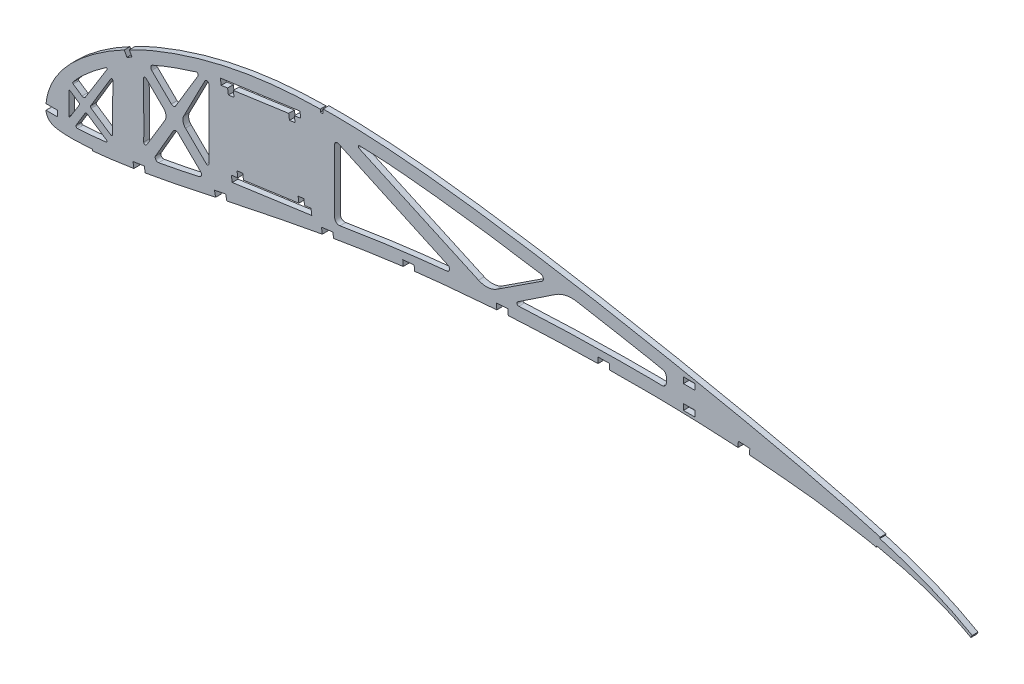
from build123d import *

# Parameters (mm, degrees)
MODEL_W             = 6.47730786
MODEL_H             = 3.303251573
MODEL_W_2           = 6.477307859
MODEL_H_2           = 3.303251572
BOSS_EXTRUDE7_DEPTH = 3.175


with BuildPart() as part:
    # Model → Boss-Extrude7 (new body)
    with BuildSketch(Plane.XY):
        with BuildLine():
            Line((44.11726, 61.64326), (45.60824, 58.8391))
            Line((45.60824, 58.8391), (48.41434449, 60.332466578))
            Line((48.41434449, 60.332466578), (46.920851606, 63.132769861))
            add(Edge.make_bspline(
                [(46.920851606, 63.132769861), (47.82292602, 63.592631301), (54.586728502, 67.040697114), (67.00115914, 72.239517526), (85.999370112, 78.543805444), (103.594629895, 82.784628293), (120.342975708, 85.455818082), (134.492681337, 86.848786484), (145.275231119, 87.430871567), (151.345831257, 87.508813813), (152.5651, 87.524468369)],
                knots=[0, 0, 0, 0, 0.027777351, 0.20827607, 0.368417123, 0.576646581, 0.703920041, 0.833446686, 0.966548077, 1, 1, 1, 1], degree=3))
            Line((152.5651, 87.524468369), (152.5651, 85.98916))
            Line((152.5651, 85.98916), (154.1526, 85.98916))
            Line((154.1526, 85.98916), (154.1526, 87.57666))
            Line((154.1526, 87.57666), (154.1526, 88.37041))
            add(Edge.make_bspline(
                [(154.1526, 88.37041), (155.731621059, 88.385872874), (160.738104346, 88.434899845), (169.278137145, 88.311070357), (178.043177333, 87.989357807), (188.981957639, 87.37798333), (200.276233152, 86.52788621), (215.806351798, 84.979052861), (229.921761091, 83.334316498), (246.609316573, 81.120828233), (263.91237427, 78.583748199), (283.860841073, 75.395508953), (304.320123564, 71.869920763), (322.823494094, 68.500988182), (341.61883959, 64.920930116), (360.548867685, 61.18513738), (381.686657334, 56.842811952), (402.303143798, 52.414912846), (422.02245449, 47.928771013), (438.656319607, 43.811278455), (451.970977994, 40.305188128), (459.066017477, 38.253438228), (462.32826, 37.31006)],
                knots=[0, 0, 0, 0, 0.015130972, 0.047974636, 0.081828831, 0.099168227, 0.15295402, 0.190340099, 0.248713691, 0.289115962, 0.351640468, 0.416281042, 0.482686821, 0.550570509, 0.596495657, 0.666024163, 0.735457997, 0.803268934, 0.868077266, 0.929230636, 0.967460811, 1, 1, 1, 1], degree=3))
            Line((462.32826, 37.31006), (462.116962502, 36.544950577))
            add(Edge.make_bspline(
                [(462.116962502, 36.544950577), (463.995110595, 35.983666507), (467.426475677, 34.958203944), (473.768868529, 32.94513194), (482.171898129, 30.081471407), (494.785513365, 25.218860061), (505.417506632, 20.052610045), (512.072642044, 16.352628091), (513.259850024, 15.692589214)],
                knots=[0, 0, 0, 0, 0.106235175, 0.194091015, 0.360618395, 0.587307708, 0.926379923, 1, 1, 1, 1], degree=3))
            Line((513.259850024, 15.692589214), (512.499875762, 14.298819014))
            add(Edge.make_bspline(
                [(508.92456, 16.23822), (509.568091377, 15.898378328), (510.767083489, 15.265204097), (511.951272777, 14.604777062), (512.499875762, 14.298819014)],
                knots=[0, 0, 0, 0, 0.536726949, 1, 1, 1, 1], degree=3))
            add(Edge.make_bspline(
                [(460.255447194, 32.208926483), (461.617944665, 31.924214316), (464.592025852, 31.302740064), (469.103767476, 30.255677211), (473.749242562, 29.117124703), (479.621798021, 27.56086396), (485.270409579, 25.899558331), (490.681181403, 24.076034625), (494.539391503, 22.674561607), (499.45836344, 20.721515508), (504.185497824, 18.584058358), (507.709797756, 16.887042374), (508.873776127, 16.265344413), (508.92456, 16.23822)],
                knots=[0, 0, 0, 0, 0.081264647, 0.177385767, 0.27039723, 0.360503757, 0.532076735, 0.614018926, 0.693834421, 0.771711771, 0.922956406, 0.996638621, 1, 1, 1, 1], degree=3))
            Line((460.255447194, 32.208926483), (460.09052, 31.4325))
            add(Edge.make_bspline(
                [(390.003479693, 40.570138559), (393.696133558, 40.308189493), (401.171556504, 39.777898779), (424.531857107, 37.271017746), (425.846732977, 37.247744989), (454.276477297, 32.811532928), (457.934486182, 31.944314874), (460.09052, 31.4325)],
                knots=[8.375363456, 8.375363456, 8.375363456, 8.375363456, 9.097405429, 9.837068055, 10.547645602, 11.002273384, 11.654976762, 11.654976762, 11.654976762, 11.654976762], degree=3))
            Line((390.003479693, 40.570138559), (390.189727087, 43.73967116))
            Line((390.189727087, 43.73967116), (383.850661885, 44.112165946))
            Line((383.850661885, 44.112165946), (383.664414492, 40.942633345))
            add(Edge.make_bspline(
                [(312.561528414, 42.518811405), (322.73029164, 42.578750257), (342.721474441, 42.69658647), (352.274604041, 42.194357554), (358.110038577, 42.247737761), (377.858355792, 41.263078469), (383.664414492, 40.942633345)],
                knots=[5.389051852, 5.389051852, 5.389051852, 5.389051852, 6.221304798, 7.025211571, 7.816696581, 8.314761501, 8.314761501, 8.314761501, 8.314761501], degree=3))
            Line((312.561528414, 42.518811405), (312.502085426, 45.693254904))
            Line((312.502085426, 45.693254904), (306.153198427, 45.574368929))
            Line((306.153198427, 45.574368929), (306.212641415, 42.39992543))
            add(Edge.make_bspline(
                [(256.577425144, 40.578467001), (258.19472619, 40.658717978), (261.436419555, 40.819571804), (280.799490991, 41.85157121), (299.501844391, 42.26806952), (306.212641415, 42.39992543)],
                knots=[2.812859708, 2.812859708, 2.812859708, 2.812859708, 3.584253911, 4.359030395, 4.978471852, 4.978471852, 4.978471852, 4.978471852], degree=3))
            Line((256.577425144, 40.578467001), (256.369159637, 43.746629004))
            Line((256.369159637, 43.746629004), (250.032835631, 43.330097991))
            Line((250.032835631, 43.330097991), (250.241101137, 40.161935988))
            add(Edge.make_bspline(
                [(204.757182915, 35.911020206), (207.188287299, 36.238548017), (211.504927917, 36.820102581), (240.327107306, 39.398134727), (248.563483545, 40.038807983), (250.241101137, 40.161935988)],
                knots=[0.842709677, 0.842709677, 0.842709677, 0.842709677, 1.815502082, 2.569988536, 2.796712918, 2.796712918, 2.796712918, 2.796712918], degree=3))
            Line((204.757182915, 35.911020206), (204.510421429, 38.770329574))
            Line((204.510421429, 38.770329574), (198.183937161, 38.22434715))
            Line((198.183937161, 38.22434715), (198.456928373, 35.061105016))
            add(Edge.make_bspline(
                [(159.926988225, 29.230952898), (164.609031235, 30.026553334), (177.525153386, 32.221337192), (192.116139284, 34.204755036), (198.456928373, 35.061105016)],
                knots=[0.005843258, 0.005843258, 0.005843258, 0.005843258, 0.281642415, 0.766676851, 0.766676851, 0.766676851, 0.766676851], degree=3))
            Line((159.926988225, 29.230952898), (159.548459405, 32.106506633))
            Line((159.548459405, 32.106506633), (153.252771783, 31.277762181))
            Line((153.252771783, 31.277762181), (153.667144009, 28.12991837))
            add(Edge.make_bspline(
                [(100.870519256, 17.62722602), (118.428129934, 21.332147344), (136.005073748, 24.964562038), (153.667144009, 28.12991837)],
                knots=[0.095249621, 0.095249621, 0.095249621, 0.095249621, 0.904455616, 0.904455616, 0.904455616, 0.904455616], degree=3))
            Line((100.870519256, 17.62722602), (100.230904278, 20.700792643))
            Line((100.230904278, 20.700792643), (94.011199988, 19.421035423))
            Line((94.011199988, 19.421035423), (94.671227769, 16.316564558))
            add(Edge.make_bspline(
                [(55.714636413, 8.524872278), (59.215079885, 9.149121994), (68.515890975, 10.807777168), (79.958069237, 13.197959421), (89.166671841, 15.138574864), (92.791642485, 15.914328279), (94.671227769, 16.316564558)],
                knots=[0.913791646, 0.913791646, 0.913791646, 0.913791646, 1.019423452, 1.194459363, 1.559412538, 1.952426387, 1.952426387, 1.952426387, 1.952426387], degree=3))
            Line((55.714636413, 8.524872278), (55.24234016, 11.589660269))
            Line((55.24234016, 11.589660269), (48.96642333, 10.622516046))
            Line((48.96642333, 10.622516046), (49.449995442, 7.484557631))
            add(Edge.make_bspline(
                [(26.438090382, 4.490846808), (27.430041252, 4.584287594), (29.150153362, 4.746320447), (31.650283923, 5.010892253), (34.000866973, 5.285360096), (36.520751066, 5.596172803), (39.2645288, 5.962779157), (42.107322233, 6.367747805), (45.684612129, 6.898909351), (46.887584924, 7.075295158), (49.195675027, 7.443938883), (49.449995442, 7.484557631)],
                knots=[0, 0, 0, 0, 0.117673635, 0.204054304, 0.29697244, 0.397031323, 0.504572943, 0.621231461, 0.747479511, 0.884171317, 0.901098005, 0.901098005, 0.901098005, 0.901098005], degree=3))
            Line((26.438090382, 4.490846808), (26.438090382, 5.284596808))
            add(Edge.make_bspline(
                [(0.841145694, 11.1125), (0.863442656, 10.889970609), (0.909573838, 10.429569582), (1.069825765, 9.747093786), (1.301062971, 9.077383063), (1.708250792, 8.23412392), (2.292441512, 7.480192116), (3.009825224, 6.83919175), (3.63339512, 6.400167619), (4.345267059, 6.045402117), (5.12230745, 5.733024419), (6.283242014, 5.403878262), (7.874796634, 5.096633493), (9.943301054, 4.89784748), (12.203632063, 4.756375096), (14.67395361, 4.684447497), (17.384104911, 4.708507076), (20.975747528, 4.860595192), (24.026581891, 5.059714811), (26.081951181, 5.251385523), (26.438090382, 5.284596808)],
                knots=[0, 0, 0, 0, 0.023329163, 0.04826675, 0.072978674, 0.097172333, 0.145790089, 0.171203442, 0.197489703, 0.225123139, 0.254044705, 0.284812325, 0.350946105, 0.422955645, 0.501603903, 0.587380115, 0.680901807, 0.784488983, 0.962657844, 1, 1, 1, 1], degree=3))
            Line((0.841145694, 11.1125), (7.19093421, 11.1125))
            Line((7.19093421, 11.1125), (7.19093421, 14.2875))
            Line((7.19093421, 14.2875), (0.896044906, 14.2875))
            add(Edge.make_bspline(
                [(0.896044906, 14.2875), (0.947375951, 14.856703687), (1.077493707, 16.29956358), (1.973597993, 20.742309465), (4.336981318, 26.915290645), (9.140267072, 34.386332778), (15.19099943, 41.228238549), (23.206475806, 48.343435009), (31.783070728, 54.467491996), (39.073511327, 58.940266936), (42.922002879, 61.002710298), (44.11726, 61.64326)],
                knots=[0, 0, 0, 0, 0.025762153, 0.065303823, 0.204051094, 0.320574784, 0.464326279, 0.614539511, 0.803095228, 0.938845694, 1, 1, 1, 1], degree=3))
        make_face()
        Polygon((97.294789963, 74.766201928), (97.75444, 71.49846), (101.291565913, 71.995482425), (101.72733034, 68.850528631), (104.876507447, 69.293032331), (104.435677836, 72.437280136), (135.088849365, 76.744538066), (135.508539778, 73.597158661), (138.652618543, 74.039192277), (138.232974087, 77.186337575), (141.7701, 77.68336), (141.310449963, 80.953641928), align=None, mode=Mode.SUBTRACT)
        with Locations((356.689505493, 58.082031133)):
            Rectangle(MODEL_W, MODEL_H, mode=Mode.SUBTRACT)
        with Locations((356.689506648, 45.25377956)):
            Rectangle(MODEL_W_2, MODEL_H_2, mode=Mode.SUBTRACT)
        with BuildLine():
            Line((84.930266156, 69.579431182), (72.602920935, 49.090167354))
            ThreePointArc((72.602920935, 49.090167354), (71.458940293, 48.34413983), (70.164568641, 48.779858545))
            Line((70.164568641, 48.779858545), (59.305800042, 59.436474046))
            ThreePointArc((59.305800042, 59.436474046), (58.828604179, 60.940489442), (59.805839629, 62.179355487))
            add(Edge.make_bspline(
                [(59.805839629, 62.179355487), (60.736017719, 62.589575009), (65.348818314, 64.588630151), (73.479838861, 67.65614267), (80.775975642, 70.053398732), (83.839548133, 70.980448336)],
                knots=[0, 0, 0, 0, 0.121620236, 0.618319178, 1, 1, 1, 1], degree=3))
            ThreePointArc((83.839548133, 70.980448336), (84.865765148, 70.654296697), (84.930266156, 69.579431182))
        make_face(mode=Mode.SUBTRACT)
        with BuildLine():
            Line((77.20377034, 46.768465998), (88.74331387, 69.136989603))
            ThreePointArc((88.74331387, 69.136989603), (90.038311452, 69.75605795), (90.96248, 68.657797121))
            Line((90.96248, 68.657797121), (90.96248, 30.423322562))
            ThreePointArc((90.96248, 30.423322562), (90.456989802, 29.631278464), (89.528642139, 29.776277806))
            Line((89.528642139, 29.776277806), (77.973411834, 41.116389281))
            ThreePointArc((77.973411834, 41.116389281), (76.621460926, 43.810733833), (77.20377034, 46.768465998))
        make_face(mode=Mode.SUBTRACT)
        with BuildLine():
            Line((86.369999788, 24.467387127), (73.88594559, 36.725249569))
            ThreePointArc((73.88594559, 36.725249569), (72.445974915, 37.203276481), (71.186033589, 36.357952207))
            Line((71.186033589, 36.357952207), (61.451577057, 19.517618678))
            ThreePointArc((61.451577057, 19.517618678), (61.530916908, 17.788245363), (63.13536968, 17.138046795))
            add(Edge.make_bspline(
                [(85.571247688, 21.70108314), (84.874800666, 21.5496818), (77.350460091, 19.756372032), (70.298205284, 18.478082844), (63.13536968, 17.138046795)],
                knots=[0, 0, 0, 0, 0.091867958, 1, 1, 1, 1], degree=3))
            ThreePointArc((85.571247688, 21.70108314), (86.795630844, 22.846019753), (86.369999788, 24.467387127))
        make_face(mode=Mode.SUBTRACT)
        with BuildLine():
            Line((66.584551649, 39.087043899), (56.549502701, 22.407802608))
            ThreePointArc((56.549502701, 22.407802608), (55.535770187, 22.011704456), (54.894615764, 22.891174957))
            add(Edge.make_bspline(
                [(54.894615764, 22.891174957), (55.166354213, 33.053589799), (54.693726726, 42.507557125), (54.72321766, 53.340426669)],
                knots=[0, 0, 0, 0, 1, 1, 1, 1], degree=3))
            ThreePointArc((54.72321766, 53.340426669), (55.291047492, 54.190692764), (56.29505411, 53.9974213))
            Line((56.29505411, 53.9974213), (65.88621165, 44.580040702))
            ThreePointArc((65.88621165, 44.580040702), (67.188549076, 41.954721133), (66.584551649, 39.087043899))
        make_face(mode=Mode.SUBTRACT)
        with BuildLine():
            Line((36.734244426, 44.162084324), (25.570519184, 25.667564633))
            ThreePointArc((25.570519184, 25.667564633), (25.465358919, 25.025425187), (25.832330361, 24.488085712))
            Line((25.832330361, 24.488085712), (36.596801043, 17.267320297))
            ThreePointArc((36.596801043, 17.267320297), (37.353170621, 17.232609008), (37.733761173, 17.887170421))
            add(Edge.make_bspline(
                [(37.733761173, 17.887170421), (37.703446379, 19.54055995), (37.87326363, 25.176274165), (37.762369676, 33.1191484), (37.78182944, 40.314960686), (37.781783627, 43.195015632), (37.781673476, 43.870554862)],
                knots=[0, 0, 0, 0, 0.189757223, 0.650834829, 0.92105654, 1, 1, 1, 1], degree=3))
            ThreePointArc((37.781673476, 43.870554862), (37.368675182, 44.414109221), (36.734244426, 44.162084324))
        make_face(mode=Mode.SUBTRACT)
        with BuildLine():
            Line((22.655802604, 28.299205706), (34.642400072, 47.59134405))
            ThreePointArc((34.642400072, 47.59134405), (34.604721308, 48.054747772), (34.150543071, 48.154170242))
            add(Edge.make_bspline(
                [(34.150543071, 48.154170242), (34.032642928, 48.101296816), (33.91325283, 48.043304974), (33.791033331, 47.982163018)],
                knots=[0, 0, 0, 0, 1, 1, 1, 1], degree=3))
            add(Edge.make_bspline(
                [(33.791033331, 47.982163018), (32.71498646, 47.234601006), (29.332669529, 44.863850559), (23.078601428, 39.891053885), (18.088351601, 34.945529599), (15.871305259, 32.253530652), (15.741066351, 32.09362211)],
                knots=[0, 0, 0, 0, 0.148043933, 0.546565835, 0.973269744, 1, 1, 1, 1], degree=3))
            ThreePointArc((15.741066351, 32.09362211), (15.605228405, 31.598252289), (15.879849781, 31.164171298))
            Line((15.879849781, 31.164171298), (20.759337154, 27.891029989))
            ThreePointArc((20.759337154, 27.891029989), (21.794200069, 27.692616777), (22.655802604, 28.299205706))
        make_face(mode=Mode.SUBTRACT)
        with BuildLine():
            Line((34.290434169, 13.58800385), (23.789372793, 20.64423634))
            ThreePointArc((23.789372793, 20.64423634), (22.998722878, 20.793681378), (22.345182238, 20.324271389))
            Line((22.345182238, 20.324271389), (17.50629624, 12.307872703))
            ThreePointArc((17.50629624, 12.307872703), (17.500606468, 11.481598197), (18.223640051, 11.081617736))
            add(Edge.make_bspline(
                [(18.223640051, 11.081617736), (20.453256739, 11.150531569), (25.156226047, 11.490511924), (30.602108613, 12.04749446), (33.518174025, 12.411292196), (34.027114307, 12.476068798)],
                knots=[0, 0, 0, 0, 0.417536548, 0.901821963, 1, 1, 1, 1], degree=3))
            ThreePointArc((34.027114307, 12.476068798), (34.543914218, 12.940830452), (34.290434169, 13.58800385))
        make_face(mode=Mode.SUBTRACT)
        with BuildLine():
            Line((13.996688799, 14.362571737), (19.272572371, 22.853978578))
            ThreePointArc((19.272572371, 22.853978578), (19.363715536, 23.378097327), (19.065370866, 23.818549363))
            Line((19.065370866, 23.818549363), (14.117205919, 27.143489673))
            ThreePointArc((14.117205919, 27.143489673), (13.730229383, 27.159659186), (13.540216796, 26.82215732))
            add(Edge.make_bspline(
                [(13.540216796, 26.82215732), (13.69574558, 22.634982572), (13.447809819, 18.942714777), (13.49501916, 14.502849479)],
                knots=[0, 0, 0, 0, 1, 1, 1, 1], degree=3))
            ThreePointArc((13.49501916, 14.502849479), (13.693222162, 14.244485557), (13.996688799, 14.362571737))
        make_face(mode=Mode.SUBTRACT)
        with BuildLine():
            Line((174.365301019, 80.849079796), (182.709330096, 80.547392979))
            add(Edge.make_bspline(
                [(182.709330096, 80.547392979), (189.199816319, 80.31272288), (203.912201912, 79.031919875), (224.705822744, 76.788018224), (247.03872104, 73.835150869), (262.952066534, 71.463589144), (272.720508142, 69.904897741), (274.488075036, 69.619753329)],
                knots=[0, 0, 0, 0, 0.21110763, 0.478099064, 0.678936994, 0.941890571, 1, 1, 1, 1], degree=3))
            ThreePointArc((274.488075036, 69.619753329), (275.951916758, 68.226849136), (275.181757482, 66.358729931))
            Line((275.181757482, 66.358729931), (250.362075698, 50.12840975))
            ThreePointArc((250.362075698, 50.12840975), (245.330327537, 48.418813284), (240.097888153, 49.34767696))
            Line((240.097888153, 49.34767696), (174.030831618, 79.431579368))
            ThreePointArc((174.030831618, 79.431579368), (173.615952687, 80.277683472), (174.365301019, 80.849079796))
        make_face(mode=Mode.SUBTRACT)
        with BuildLine():
            Line((162.692035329, 75.984069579), (223.179477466, 48.103789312))
            ThreePointArc((223.179477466, 48.103789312), (224.114193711, 46.334382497), (222.651386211, 44.968846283))
            add(Edge.make_bspline(
                [(222.651386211, 44.968846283), (219.429885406, 44.651699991), (203.1623912, 42.955665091), (182.75340423, 40.219533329), (167.30109771, 37.681391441), (163.471561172, 37.047067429)],
                knots=[0, 0, 0, 0, 0.162997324, 0.822693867, 1, 1, 1, 1], degree=3))
            add(Edge.make_bspline(
                [(163.471561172, 37.047067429), (162.977495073, 37.03157106), (162.297871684, 37.036463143), (161.29988909, 37.615558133), (160.549499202, 38.574828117), (160.492246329, 40.282225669), (160.604347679, 52.330070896), (160.530780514, 63.02292368), (160.517397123, 74.590118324)],
                knots=[0, 0, 0, 0, 0.033941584, 0.053073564, 0.084703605, 0.121131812, 0.178192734, 1, 1, 1, 1], degree=3))
            ThreePointArc((160.517397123, 74.590118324), (161.223083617, 75.882461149), (162.692035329, 75.984069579))
        make_face(mode=Mode.SUBTRACT)
        with BuildLine():
            Line((261.786598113, 49.82067586), (282.709594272, 63.755065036))
            ThreePointArc((282.709594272, 63.755065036), (288.39780437, 66.146116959), (294.567044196, 66.261630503))
            add(Edge.make_bspline(
                [(294.567044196, 66.261630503), (301.146582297, 65.126240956), (312.075694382, 63.185009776), (326.391097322, 60.497800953), (336.103465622, 58.725097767), (340.870990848, 57.682553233), (342.617761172, 57.301027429)],
                knots=[0, 0, 0, 0, 0.409181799, 0.680102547, 0.900255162, 1, 1, 1, 1], degree=3))
            add(Edge.make_bspline(
                [(342.617761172, 57.301027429), (342.855590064, 57.156402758), (343.31957025, 56.855809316), (343.92235939, 55.997987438), (344.05478134, 54.319061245), (344.063524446, 53.132312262), (344.004601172, 52.137207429)],
                knots=[0, 0, 0, 0, 0.133796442, 0.311606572, 0.520838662, 1, 1, 1, 1], degree=3))
            add(Edge.make_bspline(
                [(344.004601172, 52.137207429), (343.989781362, 51.920482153), (343.964397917, 51.619783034), (343.741159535, 50.897536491), (343.143717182, 50.094363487), (342.189230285, 49.637788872), (340.584683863, 49.54659478), (331.356398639, 49.969505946), (318.782710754, 49.681439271), (295.930417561, 49.426980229), (278.642526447, 48.841909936), (264.875584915, 48.130545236), (262.394808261, 47.993570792)],
                knots=[0, 0, 0, 0, 0.007132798, 0.011727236, 0.026840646, 0.041958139, 0.048068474, 0.08473426, 0.375472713, 0.502002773, 0.910258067, 1, 1, 1, 1], degree=3))
            ThreePointArc((262.394808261, 47.993570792), (261.392887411, 48.674833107), (261.786598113, 49.82067586))
        make_face(mode=Mode.SUBTRACT)
        Polygon((147.880616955, 34.205146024), (147.420966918, 37.472887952), (143.883841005, 36.975865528), (143.448076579, 40.120819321), (140.298899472, 39.678315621), (140.739729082, 36.534067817), (110.086557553, 32.226809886), (109.666867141, 35.374189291), (106.522788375, 34.932155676), (106.942432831, 31.785010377), (103.405306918, 31.287987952), (103.864956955, 28.017706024), align=None, mode=Mode.SUBTRACT)
    extrude(amount=BOSS_EXTRUDE7_DEPTH)


solid = part.part
